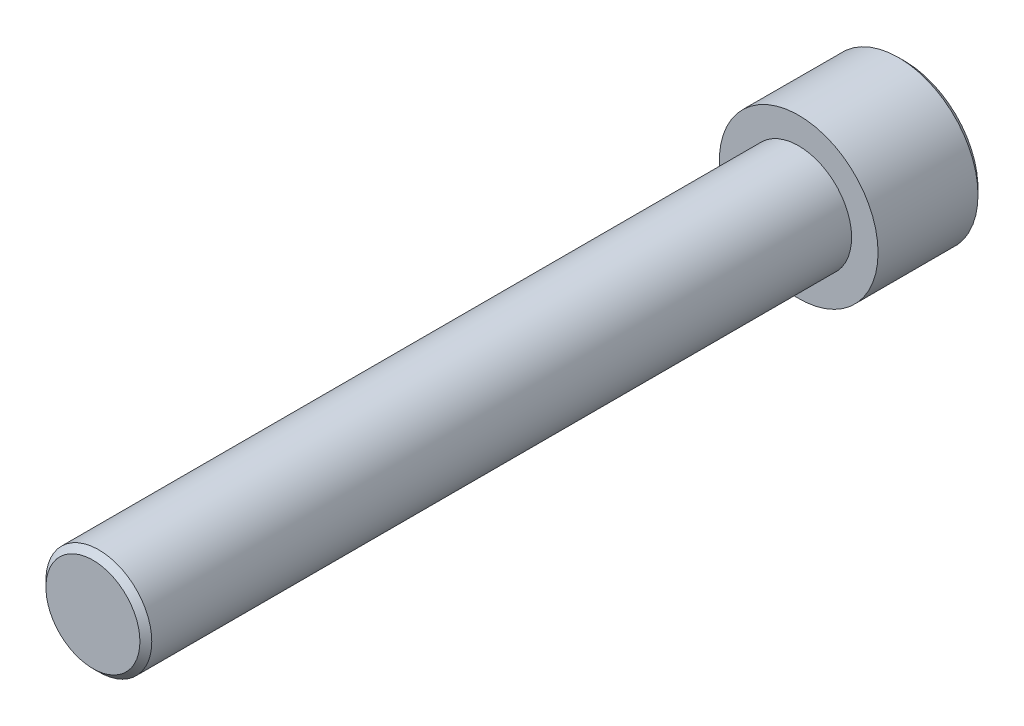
from build123d import *

# Parameters (mm, degrees)
CUT_EXTRUDE1_DEPTH = 6.35
CHAMFER2_SIZE      = 0.5334
CHAMFER3_SIZE      = 0.5334


with BuildPart() as part:
    # Sketch1 → Revolve1 (revolve)
    with BuildSketch(Plane(origin=(0, 0, 0), x_dir=(1, 0, 0), z_dir=(0, 1, 0))):
        Polygon((0, -63.5), (4.7625, -63.5), (4.7625, 0), (7.14375, 0), (7.14375, 9.525), (0, 9.525), (0, 0), align=None)
    revolve(axis=Axis((0, 0, 63.5), (0, 0, -1)))

    # Sketch2 → Cut-Extrude1 (cut)
    with BuildSketch(Plane(origin=(0, 0, -9.525), x_dir=(-1, 0, 0), z_dir=(0, 0, -1))):
        Polygon((-3.978168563, -2.274967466), (-0.018904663, -4.582678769), (3.9592639, -2.307711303), (3.978168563, 2.274967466), (0.018904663, 4.582678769), (-3.9592639, 2.307711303), align=None)
    extrude(amount=-CUT_EXTRUDE1_DEPTH, mode=Mode.SUBTRACT)

    # Chamfer2
    chamfer2_edges = [part.edges().sort_by_distance(p)[0] for p in [
        (-7.14375, 0, -9.525),
    ]]
    chamfer(chamfer2_edges, length=CHAMFER2_SIZE)

    # Chamfer3
    chamfer3_edges = [part.edges().sort_by_distance(p)[0] for p in [
        (-4.7625, 0, 63.5),
    ]]
    chamfer(chamfer3_edges, length=CHAMFER3_SIZE)


solid = part.part
